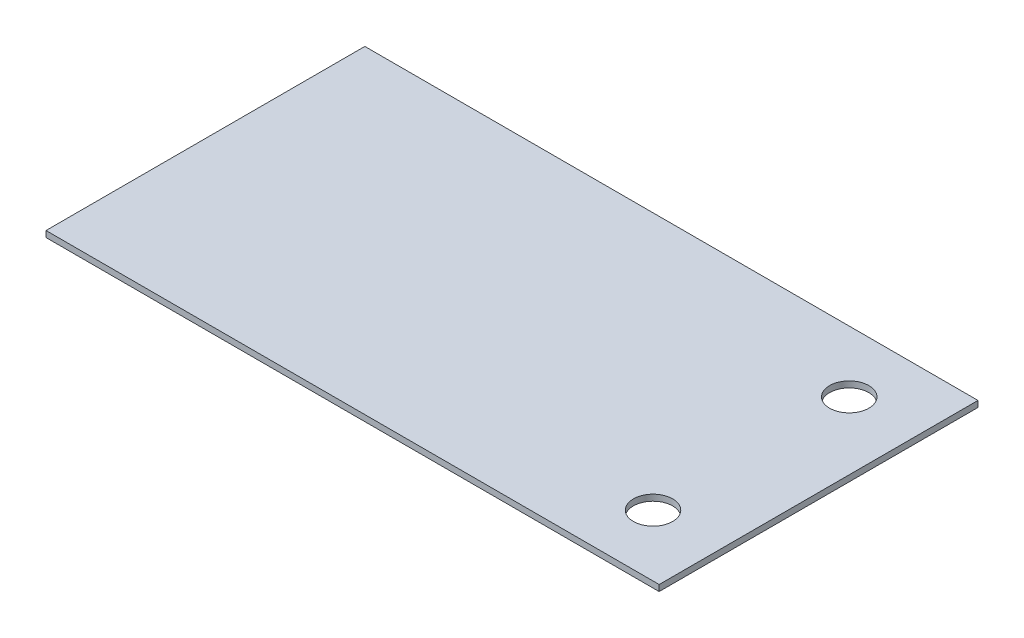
ISO-10303-21;
HEADER;
FILE_DESCRIPTION(('STEP AP214'),'2;1');
FILE_NAME('part.step','',(''),(''),'','','');
FILE_SCHEMA(('AUTOMOTIVE_DESIGN { 1 0 10303 214 1 1 1 1 }'));
ENDSEC;
DATA;
#1=APPLICATION_CONTEXT('core data for automotive mechanical design processes');
#2=APPLICATION_PROTOCOL_DEFINITION('international standard','automotive_design',2000,#1);
#3=PRODUCT_CONTEXT('',#1,'mechanical');
#4=PRODUCT('Part','Part','',(#3));
#5=PRODUCT_RELATED_PRODUCT_CATEGORY('part','',(#4));
#6=PRODUCT_DEFINITION_FORMATION('','',#4);
#7=PRODUCT_DEFINITION_CONTEXT('part definition',#1,'design');
#8=PRODUCT_DEFINITION('design','',#6,#7);
#9=PRODUCT_DEFINITION_SHAPE('','',#8);
#10=(LENGTH_UNIT() NAMED_UNIT(*) SI_UNIT(.MILLI.,.METRE.));
#11=(NAMED_UNIT(*) PLANE_ANGLE_UNIT() SI_UNIT($,.RADIAN.));
#12=(NAMED_UNIT(*) SI_UNIT($,.STERADIAN.) SOLID_ANGLE_UNIT());
#13=UNCERTAINTY_MEASURE_WITH_UNIT(LENGTH_MEASURE(1.E-05),#10,'distance_accuracy_value','');
#14=(GEOMETRIC_REPRESENTATION_CONTEXT(3) GLOBAL_UNCERTAINTY_ASSIGNED_CONTEXT((#13)) GLOBAL_UNIT_ASSIGNED_CONTEXT((#10,
#11,#12)) REPRESENTATION_CONTEXT('',''));
#15=CARTESIAN_POINT('',(0.,0.,0.));
#16=DIRECTION('',(0.,0.,1.));
#17=DIRECTION('',(1.,0.,0.));
#18=AXIS2_PLACEMENT_3D('',#15,#16,#17);
#19=CARTESIAN_POINT('',(0.,0.5,0.));
#20=DIRECTION('',(0.,-1.,0.));
#21=DIRECTION('',(0.,0.,-1.));
#22=AXIS2_PLACEMENT_3D('',#19,#20,#21);
#23=PLANE('',#22);
#24=DIRECTION('',(0.,0.,1.));
#25=VECTOR('',#24,1.);
#26=CARTESIAN_POINT('',(0.,0.5,0.));
#27=LINE('',#26,#25);
#28=CARTESIAN_POINT('',(0.,0.5,-26.));
#29=VERTEX_POINT('',#28);
#30=CARTESIAN_POINT('',(0.,0.5,0.));
#31=VERTEX_POINT('',#30);
#32=EDGE_CURVE('E84',#29,#31,#27,.T.);
#33=ORIENTED_EDGE('',*,*,#32,.T.);
#34=DIRECTION('',(1.,0.,0.));
#35=VECTOR('',#34,1.);
#36=CARTESIAN_POINT('',(0.,0.5,0.));
#37=LINE('',#36,#35);
#38=CARTESIAN_POINT('',(50.,0.5,0.));
#39=VERTEX_POINT('',#38);
#40=EDGE_CURVE('E79',#31,#39,#37,.T.);
#41=ORIENTED_EDGE('',*,*,#40,.T.);
#42=DIRECTION('',(0.,0.,-1.));
#43=VECTOR('',#42,1.);
#44=CARTESIAN_POINT('',(50.,0.5,0.));
#45=LINE('',#44,#43);
#46=CARTESIAN_POINT('',(50.,0.5,-26.));
#47=VERTEX_POINT('',#46);
#48=EDGE_CURVE('E82',#39,#47,#45,.T.);
#49=ORIENTED_EDGE('',*,*,#48,.T.);
#50=DIRECTION('',(-1.,0.,0.));
#51=VECTOR('',#50,1.);
#52=CARTESIAN_POINT('',(0.,0.5,-26.));
#53=LINE('',#52,#51);
#54=EDGE_CURVE('E49',#47,#29,#53,.T.);
#55=ORIENTED_EDGE('',*,*,#54,.T.);
#56=EDGE_LOOP('',(#33,#41,#49,#55));
#57=FACE_BOUND('',#56,.T.);
#58=CARTESIAN_POINT('',(44.5,0.5,-5.));
#59=DIRECTION('',(0.,1.,0.));
#60=DIRECTION('',(0.,0.,1.));
#61=AXIS2_PLACEMENT_3D('',#58,#59,#60);
#62=CIRCLE('',#61,1.6);
#63=CARTESIAN_POINT('',(44.5,0.5,-3.4));
#64=VERTEX_POINT('',#63);
#65=EDGE_CURVE('E99',#64,#64,#62,.T.);
#66=ORIENTED_EDGE('',*,*,#65,.F.);
#67=EDGE_LOOP('',(#66));
#68=FACE_BOUND('',#67,.T.);
#69=CARTESIAN_POINT('',(44.5,0.5,-21.));
#70=DIRECTION('',(0.,1.,0.));
#71=DIRECTION('',(0.,0.,1.));
#72=AXIS2_PLACEMENT_3D('',#69,#70,#71);
#73=CIRCLE('',#72,1.6);
#74=CARTESIAN_POINT('',(44.5,0.5,-19.4));
#75=VERTEX_POINT('',#74);
#76=EDGE_CURVE('E114',#75,#75,#73,.T.);
#77=ORIENTED_EDGE('',*,*,#76,.F.);
#78=EDGE_LOOP('',(#77));
#79=FACE_BOUND('',#78,.T.);
#80=ADVANCED_FACE('F32',(#57,#68,#79),#23,.F.);
#81=CARTESIAN_POINT('',(0.,0.,0.));
#82=DIRECTION('',(0.,-1.,0.));
#83=DIRECTION('',(0.,0.,-1.));
#84=AXIS2_PLACEMENT_3D('',#81,#82,#83);
#85=PLANE('',#84);
#86=CARTESIAN_POINT('',(44.5,0.,-5.));
#87=DIRECTION('',(0.,1.,0.));
#88=DIRECTION('',(0.,0.,1.));
#89=AXIS2_PLACEMENT_3D('',#86,#87,#88);
#90=CIRCLE('',#89,1.6);
#91=CARTESIAN_POINT('',(44.5,0.,-3.4));
#92=VERTEX_POINT('',#91);
#93=EDGE_CURVE('E111',#92,#92,#90,.T.);
#94=ORIENTED_EDGE('',*,*,#93,.T.);
#95=EDGE_LOOP('',(#94));
#96=FACE_BOUND('',#95,.T.);
#97=DIRECTION('',(0.,0.,1.));
#98=VECTOR('',#97,1.);
#99=CARTESIAN_POINT('',(0.,0.,0.));
#100=LINE('',#99,#98);
#101=CARTESIAN_POINT('',(0.,0.,-26.));
#102=VERTEX_POINT('',#101);
#103=CARTESIAN_POINT('',(0.,0.,0.));
#104=VERTEX_POINT('',#103);
#105=EDGE_CURVE('E96',#102,#104,#100,.T.);
#106=ORIENTED_EDGE('',*,*,#105,.F.);
#107=DIRECTION('',(-1.,0.,0.));
#108=VECTOR('',#107,1.);
#109=CARTESIAN_POINT('',(0.,0.,-26.));
#110=LINE('',#109,#108);
#111=CARTESIAN_POINT('',(50.,0.,-26.));
#112=VERTEX_POINT('',#111);
#113=EDGE_CURVE('E72',#112,#102,#110,.T.);
#114=ORIENTED_EDGE('',*,*,#113,.F.);
#115=DIRECTION('',(0.,0.,-1.));
#116=VECTOR('',#115,1.);
#117=CARTESIAN_POINT('',(50.,0.,0.));
#118=LINE('',#117,#116);
#119=CARTESIAN_POINT('',(50.,0.,0.));
#120=VERTEX_POINT('',#119);
#121=EDGE_CURVE('E66',#120,#112,#118,.T.);
#122=ORIENTED_EDGE('',*,*,#121,.F.);
#123=DIRECTION('',(1.,0.,0.));
#124=VECTOR('',#123,1.);
#125=CARTESIAN_POINT('',(0.,0.,0.));
#126=LINE('',#125,#124);
#127=EDGE_CURVE('E88',#104,#120,#126,.T.);
#128=ORIENTED_EDGE('',*,*,#127,.F.);
#129=EDGE_LOOP('',(#106,#114,#122,#128));
#130=FACE_BOUND('',#129,.T.);
#131=CARTESIAN_POINT('',(44.5,0.,-21.));
#132=DIRECTION('',(0.,1.,0.));
#133=DIRECTION('',(0.,0.,1.));
#134=AXIS2_PLACEMENT_3D('',#131,#132,#133);
#135=CIRCLE('',#134,1.6);
#136=CARTESIAN_POINT('',(44.5,0.,-19.4));
#137=VERTEX_POINT('',#136);
#138=EDGE_CURVE('E117',#137,#137,#135,.T.);
#139=ORIENTED_EDGE('',*,*,#138,.T.);
#140=EDGE_LOOP('',(#139));
#141=FACE_BOUND('',#140,.T.);
#142=ADVANCED_FACE('F107',(#96,#130,#141),#85,.T.);
#143=CARTESIAN_POINT('',(0.,0.5,0.));
#144=DIRECTION('',(1.,0.,0.));
#145=DIRECTION('',(0.,0.,-1.));
#146=AXIS2_PLACEMENT_3D('',#143,#144,#145);
#147=PLANE('',#146);
#148=ORIENTED_EDGE('',*,*,#105,.T.);
#149=DIRECTION('',(0.,-1.,0.));
#150=VECTOR('',#149,1.);
#151=CARTESIAN_POINT('',(0.,0.5,0.));
#152=LINE('',#151,#150);
#153=EDGE_CURVE('E11',#31,#104,#152,.T.);
#154=ORIENTED_EDGE('',*,*,#153,.F.);
#155=ORIENTED_EDGE('',*,*,#32,.F.);
#156=DIRECTION('',(0.,-1.,0.));
#157=VECTOR('',#156,1.);
#158=CARTESIAN_POINT('',(0.,0.5,-26.));
#159=LINE('',#158,#157);
#160=EDGE_CURVE('E92',#29,#102,#159,.T.);
#161=ORIENTED_EDGE('',*,*,#160,.T.);
#162=EDGE_LOOP('',(#148,#154,#155,#161));
#163=FACE_BOUND('',#162,.T.);
#164=ADVANCED_FACE('F34',(#163),#147,.F.);
#165=CARTESIAN_POINT('',(0.,0.5,0.));
#166=DIRECTION('',(0.,0.,-1.));
#167=DIRECTION('',(-1.,0.,0.));
#168=AXIS2_PLACEMENT_3D('',#165,#166,#167);
#169=PLANE('',#168);
#170=ORIENTED_EDGE('',*,*,#127,.T.);
#171=DIRECTION('',(0.,-1.,0.));
#172=VECTOR('',#171,1.);
#173=CARTESIAN_POINT('',(50.,0.5,0.));
#174=LINE('',#173,#172);
#175=EDGE_CURVE('E41',#39,#120,#174,.T.);
#176=ORIENTED_EDGE('',*,*,#175,.F.);
#177=ORIENTED_EDGE('',*,*,#40,.F.);
#178=ORIENTED_EDGE('',*,*,#153,.T.);
#179=EDGE_LOOP('',(#170,#176,#177,#178));
#180=FACE_BOUND('',#179,.T.);
#181=ADVANCED_FACE('F87',(#180),#169,.F.);
#182=CARTESIAN_POINT('',(50.,0.5,0.));
#183=DIRECTION('',(-1.,0.,0.));
#184=DIRECTION('',(0.,0.,1.));
#185=AXIS2_PLACEMENT_3D('',#182,#183,#184);
#186=PLANE('',#185);
#187=ORIENTED_EDGE('',*,*,#121,.T.);
#188=DIRECTION('',(0.,-1.,0.));
#189=VECTOR('',#188,1.);
#190=CARTESIAN_POINT('',(50.,0.5,-26.));
#191=LINE('',#190,#189);
#192=EDGE_CURVE('E89',#47,#112,#191,.T.);
#193=ORIENTED_EDGE('',*,*,#192,.F.);
#194=ORIENTED_EDGE('',*,*,#48,.F.);
#195=ORIENTED_EDGE('',*,*,#175,.T.);
#196=EDGE_LOOP('',(#187,#193,#194,#195));
#197=FACE_BOUND('',#196,.T.);
#198=ADVANCED_FACE('F90',(#197),#186,.F.);
#199=CARTESIAN_POINT('',(0.,0.5,-26.));
#200=DIRECTION('',(0.,0.,1.));
#201=DIRECTION('',(1.,0.,0.));
#202=AXIS2_PLACEMENT_3D('',#199,#200,#201);
#203=PLANE('',#202);
#204=ORIENTED_EDGE('',*,*,#113,.T.);
#205=ORIENTED_EDGE('',*,*,#160,.F.);
#206=ORIENTED_EDGE('',*,*,#54,.F.);
#207=ORIENTED_EDGE('',*,*,#192,.T.);
#208=EDGE_LOOP('',(#204,#205,#206,#207));
#209=FACE_BOUND('',#208,.T.);
#210=ADVANCED_FACE('F104',(#209),#203,.F.);
#211=CARTESIAN_POINT('',(44.5,0.5,-5.));
#212=DIRECTION('',(0.,-1.,0.));
#213=DIRECTION('',(0.,0.,-1.));
#214=AXIS2_PLACEMENT_3D('',#211,#212,#213);
#215=CYLINDRICAL_SURFACE('',#214,1.6);
#216=ORIENTED_EDGE('',*,*,#65,.T.);
#217=EDGE_LOOP('',(#216));
#218=FACE_BOUND('',#217,.T.);
#219=ORIENTED_EDGE('',*,*,#93,.F.);
#220=EDGE_LOOP('',(#219));
#221=FACE_BOUND('',#220,.T.);
#222=ADVANCED_FACE('F134',(#218,#221),#215,.F.);
#223=CARTESIAN_POINT('',(44.5,0.5,-21.));
#224=DIRECTION('',(0.,-1.,0.));
#225=DIRECTION('',(0.,0.,-1.));
#226=AXIS2_PLACEMENT_3D('',#223,#224,#225);
#227=CYLINDRICAL_SURFACE('',#226,1.6);
#228=ORIENTED_EDGE('',*,*,#76,.T.);
#229=EDGE_LOOP('',(#228));
#230=FACE_BOUND('',#229,.T.);
#231=ORIENTED_EDGE('',*,*,#138,.F.);
#232=EDGE_LOOP('',(#231));
#233=FACE_BOUND('',#232,.T.);
#234=ADVANCED_FACE('F123',(#230,#233),#227,.F.);
#235=CLOSED_SHELL('',(#80,#142,#164,#181,#198,#210,#222,#234));
#236=MANIFOLD_SOLID_BREP('B2',#235);
#237=ADVANCED_BREP_SHAPE_REPRESENTATION('',(#18,#236),#14);
#238=SHAPE_DEFINITION_REPRESENTATION(#9,#237);
ENDSEC;
END-ISO-10303-21;
